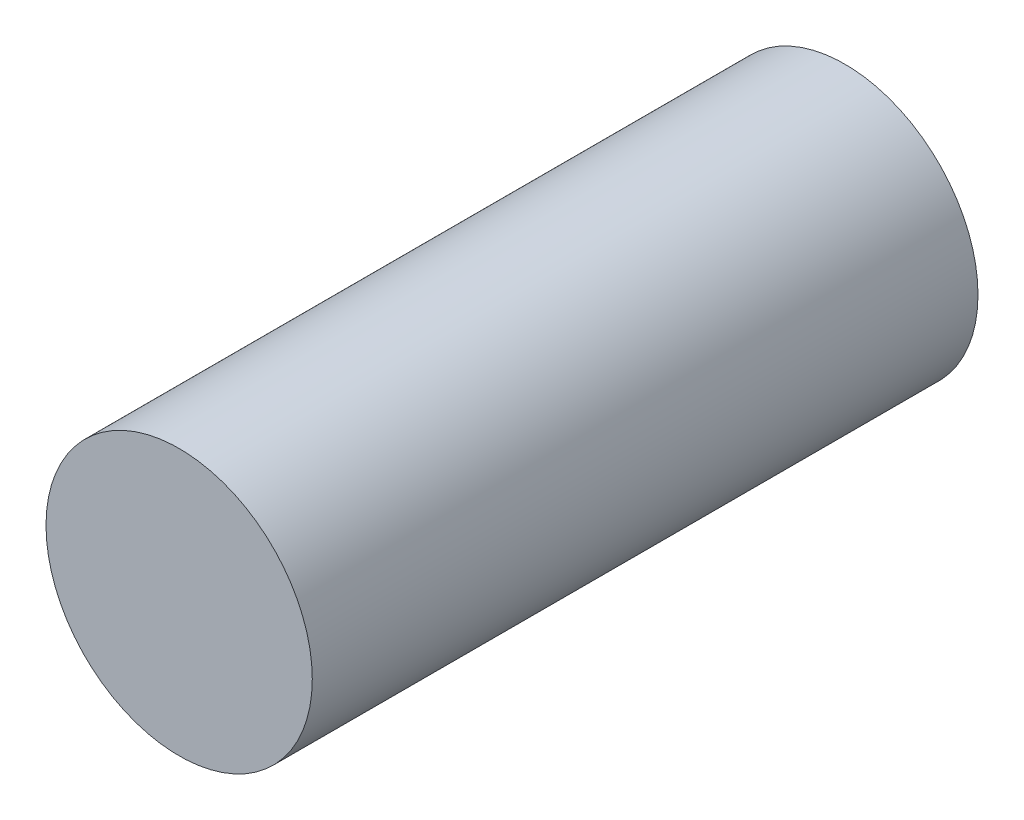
from build123d import *

# Parameters (mm, degrees)
ESQUISSE1_R      = 4
EXTRUSION1_DEPTH = 20


with BuildPart() as part:
    # Esquisse1 → Extrusion1 (new body)
    with BuildSketch(Plane.XY):
        Circle(ESQUISSE1_R)
    extrude(amount=EXTRUSION1_DEPTH)


solid = part.part
